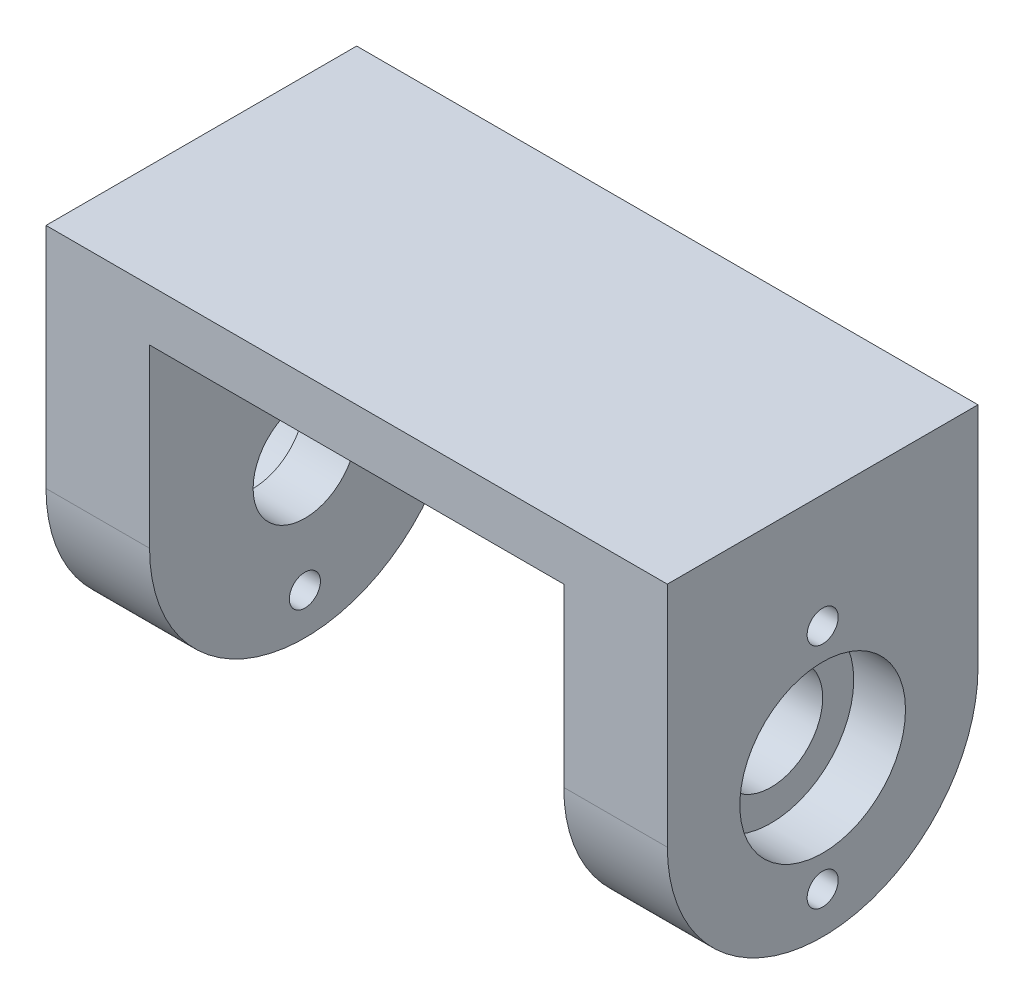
ISO-10303-21;
HEADER;
FILE_DESCRIPTION(('STEP AP214'),'2;1');
FILE_NAME('part.step','',(''),(''),'','','');
FILE_SCHEMA(('AUTOMOTIVE_DESIGN { 1 0 10303 214 1 1 1 1 }'));
ENDSEC;
DATA;
#1=APPLICATION_CONTEXT('core data for automotive mechanical design processes');
#2=APPLICATION_PROTOCOL_DEFINITION('international standard','automotive_design',2000,#1);
#3=PRODUCT_CONTEXT('',#1,'mechanical');
#4=PRODUCT('Part','Part','',(#3));
#5=PRODUCT_RELATED_PRODUCT_CATEGORY('part','',(#4));
#6=PRODUCT_DEFINITION_FORMATION('','',#4);
#7=PRODUCT_DEFINITION_CONTEXT('part definition',#1,'design');
#8=PRODUCT_DEFINITION('design','',#6,#7);
#9=PRODUCT_DEFINITION_SHAPE('','',#8);
#10=(LENGTH_UNIT() NAMED_UNIT(*) SI_UNIT(.MILLI.,.METRE.));
#11=(NAMED_UNIT(*) PLANE_ANGLE_UNIT() SI_UNIT($,.RADIAN.));
#12=(NAMED_UNIT(*) SI_UNIT($,.STERADIAN.) SOLID_ANGLE_UNIT());
#13=UNCERTAINTY_MEASURE_WITH_UNIT(LENGTH_MEASURE(1.E-05),#10,'distance_accuracy_value','');
#14=(GEOMETRIC_REPRESENTATION_CONTEXT(3) GLOBAL_UNCERTAINTY_ASSIGNED_CONTEXT((#13)) GLOBAL_UNIT_ASSIGNED_CONTEXT((#10,
#11,#12)) REPRESENTATION_CONTEXT('',''));
#15=CARTESIAN_POINT('',(0.,0.,0.));
#16=DIRECTION('',(0.,0.,1.));
#17=DIRECTION('',(1.,0.,0.));
#18=AXIS2_PLACEMENT_3D('',#15,#16,#17);
#19=CARTESIAN_POINT('',(60.,0.,0.));
#20=DIRECTION('',(-1.,0.,0.));
#21=DIRECTION('',(0.,0.,1.));
#22=AXIS2_PLACEMENT_3D('',#19,#20,#21);
#23=CYLINDRICAL_SURFACE('',#22,5.);
#24=CARTESIAN_POINT('',(50.,0.,0.));
#25=DIRECTION('',(1.,0.,0.));
#26=DIRECTION('',(0.,1.,0.));
#27=AXIS2_PLACEMENT_3D('',#24,#25,#26);
#28=CIRCLE('',#27,5.);
#29=CARTESIAN_POINT('',(50.,5.,0.));
#30=VERTEX_POINT('',#29);
#31=EDGE_CURVE('E141',#30,#30,#28,.T.);
#32=ORIENTED_EDGE('',*,*,#31,.F.);
#33=EDGE_LOOP('',(#32));
#34=FACE_BOUND('',#33,.T.);
#35=CARTESIAN_POINT('',(55.,0.,0.));
#36=DIRECTION('',(1.,0.,0.));
#37=DIRECTION('',(0.,0.,-1.));
#38=AXIS2_PLACEMENT_3D('',#35,#36,#37);
#39=CIRCLE('',#38,5.);
#40=CARTESIAN_POINT('',(55.,0.,-5.));
#41=VERTEX_POINT('',#40);
#42=EDGE_CURVE('E178',#41,#41,#39,.T.);
#43=ORIENTED_EDGE('',*,*,#42,.T.);
#44=EDGE_LOOP('',(#43));
#45=FACE_BOUND('',#44,.T.);
#46=ADVANCED_FACE('F37',(#34,#45),#23,.F.);
#47=CARTESIAN_POINT('',(9.99999999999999,0.,0.));
#48=DIRECTION('',(-1.,0.,0.));
#49=DIRECTION('',(0.,-1.,0.));
#50=AXIS2_PLACEMENT_3D('',#47,#48,#49);
#51=CIRCLE('',#50,5.);
#52=CARTESIAN_POINT('',(9.99999999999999,-5.,0.));
#53=VERTEX_POINT('',#52);
#54=EDGE_CURVE('E139',#53,#53,#51,.T.);
#55=ORIENTED_EDGE('',*,*,#54,.F.);
#56=EDGE_LOOP('',(#55));
#57=FACE_BOUND('',#56,.T.);
#58=CARTESIAN_POINT('',(5.,0.,0.));
#59=DIRECTION('',(-1.,0.,0.));
#60=DIRECTION('',(0.,0.,1.));
#61=AXIS2_PLACEMENT_3D('',#58,#59,#60);
#62=CIRCLE('',#61,5.);
#63=CARTESIAN_POINT('',(5.,0.,5.));
#64=VERTEX_POINT('',#63);
#65=EDGE_CURVE('E174',#64,#64,#62,.T.);
#66=ORIENTED_EDGE('',*,*,#65,.T.);
#67=EDGE_LOOP('',(#66));
#68=FACE_BOUND('',#67,.T.);
#69=ADVANCED_FACE('F234',(#57,#68),#23,.F.);
#70=CARTESIAN_POINT('',(60.,0.,0.));
#71=DIRECTION('',(-1.,0.,0.));
#72=DIRECTION('',(0.,0.,1.));
#73=AXIS2_PLACEMENT_3D('',#70,#71,#72);
#74=CYLINDRICAL_SURFACE('',#73,15.);
#75=DIRECTION('',(-1.,0.,0.));
#76=VECTOR('',#75,1.);
#77=CARTESIAN_POINT('',(60.,0.,15.));
#78=LINE('',#77,#76);
#79=CARTESIAN_POINT('',(60.,0.,15.));
#80=VERTEX_POINT('',#79);
#81=CARTESIAN_POINT('',(50.,0.,15.));
#82=VERTEX_POINT('',#81);
#83=EDGE_CURVE('E11',#80,#82,#78,.T.);
#84=ORIENTED_EDGE('',*,*,#83,.T.);
#85=CARTESIAN_POINT('',(50.,0.,0.));
#86=DIRECTION('',(1.,0.,0.));
#87=DIRECTION('',(0.,1.,0.));
#88=AXIS2_PLACEMENT_3D('',#85,#86,#87);
#89=CIRCLE('',#88,15.);
#90=CARTESIAN_POINT('',(50.,0.,-15.));
#91=VERTEX_POINT('',#90);
#92=EDGE_CURVE('E114',#82,#91,#89,.T.);
#93=ORIENTED_EDGE('',*,*,#92,.T.);
#94=DIRECTION('',(-1.,0.,0.));
#95=VECTOR('',#94,1.);
#96=CARTESIAN_POINT('',(60.,0.,-15.));
#97=LINE('',#96,#95);
#98=CARTESIAN_POINT('',(60.,0.,-15.));
#99=VERTEX_POINT('',#98);
#100=EDGE_CURVE('E167',#99,#91,#97,.T.);
#101=ORIENTED_EDGE('',*,*,#100,.F.);
#102=CARTESIAN_POINT('',(60.,0.,0.));
#103=DIRECTION('',(1.,0.,0.));
#104=DIRECTION('',(0.,0.,-1.));
#105=AXIS2_PLACEMENT_3D('',#102,#103,#104);
#106=CIRCLE('',#105,15.);
#107=EDGE_CURVE('E146',#80,#99,#106,.T.);
#108=ORIENTED_EDGE('',*,*,#107,.F.);
#109=EDGE_LOOP('',(#84,#93,#101,#108));
#110=FACE_BOUND('',#109,.T.);
#111=ADVANCED_FACE('F214',(#110),#74,.T.);
#112=CARTESIAN_POINT('',(60.,0.,15.));
#113=DIRECTION('',(0.,0.,1.));
#114=DIRECTION('',(1.,0.,0.));
#115=AXIS2_PLACEMENT_3D('',#112,#113,#114);
#116=PLANE('',#115);
#117=DIRECTION('',(0.,-1.,0.));
#118=VECTOR('',#117,1.);
#119=CARTESIAN_POINT('',(50.,17.,15.));
#120=LINE('',#119,#118);
#121=CARTESIAN_POINT('',(50.,17.,15.));
#122=VERTEX_POINT('',#121);
#123=EDGE_CURVE('E108',#122,#82,#120,.T.);
#124=ORIENTED_EDGE('',*,*,#123,.T.);
#125=ORIENTED_EDGE('',*,*,#83,.F.);
#126=DIRECTION('',(0.,1.,0.));
#127=VECTOR('',#126,1.);
#128=CARTESIAN_POINT('',(60.,0.,15.));
#129=LINE('',#128,#127);
#130=CARTESIAN_POINT('',(60.,22.,15.));
#131=VERTEX_POINT('',#130);
#132=EDGE_CURVE('E144',#80,#131,#129,.T.);
#133=ORIENTED_EDGE('',*,*,#132,.T.);
#134=DIRECTION('',(-1.,0.,0.));
#135=VECTOR('',#134,1.);
#136=CARTESIAN_POINT('',(60.,22.,15.));
#137=LINE('',#136,#135);
#138=CARTESIAN_POINT('',(0.,22.,15.));
#139=VERTEX_POINT('',#138);
#140=EDGE_CURVE('E63',#131,#139,#137,.T.);
#141=ORIENTED_EDGE('',*,*,#140,.T.);
#142=DIRECTION('',(0.,1.,0.));
#143=VECTOR('',#142,1.);
#144=CARTESIAN_POINT('',(0.,0.,15.));
#145=LINE('',#144,#143);
#146=CARTESIAN_POINT('',(0.,0.,15.));
#147=VERTEX_POINT('',#146);
#148=EDGE_CURVE('E143',#147,#139,#145,.T.);
#149=ORIENTED_EDGE('',*,*,#148,.F.);
#150=CARTESIAN_POINT('',(9.99999999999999,0.,15.));
#151=VERTEX_POINT('',#150);
#152=EDGE_CURVE('E46',#151,#147,#78,.T.);
#153=ORIENTED_EDGE('',*,*,#152,.F.);
#154=DIRECTION('',(0.,1.,0.));
#155=VECTOR('',#154,1.);
#156=CARTESIAN_POINT('',(9.99999999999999,17.,15.));
#157=LINE('',#156,#155);
#158=CARTESIAN_POINT('',(9.99999999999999,17.,15.));
#159=VERTEX_POINT('',#158);
#160=EDGE_CURVE('E116',#151,#159,#157,.T.);
#161=ORIENTED_EDGE('',*,*,#160,.T.);
#162=DIRECTION('',(1.,0.,0.));
#163=VECTOR('',#162,1.);
#164=CARTESIAN_POINT('',(9.99999999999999,17.,15.));
#165=LINE('',#164,#163);
#166=EDGE_CURVE('E121',#159,#122,#165,.T.);
#167=ORIENTED_EDGE('',*,*,#166,.T.);
#168=EDGE_LOOP('',(#124,#125,#133,#141,#149,#153,#161,#167));
#169=FACE_BOUND('',#168,.T.);
#170=ADVANCED_FACE('F39',(#169),#116,.T.);
#171=CARTESIAN_POINT('',(9.99999999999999,0.,-15.));
#172=VERTEX_POINT('',#171);
#173=CARTESIAN_POINT('',(0.,0.,-15.));
#174=VERTEX_POINT('',#173);
#175=EDGE_CURVE('E166',#172,#174,#97,.T.);
#176=ORIENTED_EDGE('',*,*,#175,.F.);
#177=CARTESIAN_POINT('',(9.99999999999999,0.,0.));
#178=DIRECTION('',(-1.,0.,0.));
#179=DIRECTION('',(0.,-1.,0.));
#180=AXIS2_PLACEMENT_3D('',#177,#178,#179);
#181=CIRCLE('',#180,15.);
#182=EDGE_CURVE('E54',#172,#151,#181,.T.);
#183=ORIENTED_EDGE('',*,*,#182,.T.);
#184=ORIENTED_EDGE('',*,*,#152,.T.);
#185=CARTESIAN_POINT('',(0.,0.,0.));
#186=DIRECTION('',(1.,0.,0.));
#187=DIRECTION('',(0.,0.,-1.));
#188=AXIS2_PLACEMENT_3D('',#185,#186,#187);
#189=CIRCLE('',#188,15.);
#190=EDGE_CURVE('E155',#147,#174,#189,.T.);
#191=ORIENTED_EDGE('',*,*,#190,.T.);
#192=EDGE_LOOP('',(#176,#183,#184,#191));
#193=FACE_BOUND('',#192,.T.);
#194=ADVANCED_FACE('F226',(#193),#74,.T.);
#195=CARTESIAN_POINT('',(60.,0.,-15.));
#196=DIRECTION('',(0.,0.,-1.));
#197=DIRECTION('',(-1.,0.,0.));
#198=AXIS2_PLACEMENT_3D('',#195,#196,#197);
#199=PLANE('',#198);
#200=DIRECTION('',(0.,-1.,0.));
#201=VECTOR('',#200,1.);
#202=CARTESIAN_POINT('',(50.,17.,-15.));
#203=LINE('',#202,#201);
#204=CARTESIAN_POINT('',(50.,17.,-15.));
#205=VERTEX_POINT('',#204);
#206=EDGE_CURVE('E129',#205,#91,#203,.T.);
#207=ORIENTED_EDGE('',*,*,#206,.F.);
#208=DIRECTION('',(1.,0.,0.));
#209=VECTOR('',#208,1.);
#210=CARTESIAN_POINT('',(9.99999999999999,17.,-15.));
#211=LINE('',#210,#209);
#212=CARTESIAN_POINT('',(9.99999999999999,17.,-15.));
#213=VERTEX_POINT('',#212);
#214=EDGE_CURVE('E124',#213,#205,#211,.T.);
#215=ORIENTED_EDGE('',*,*,#214,.F.);
#216=DIRECTION('',(0.,1.,0.));
#217=VECTOR('',#216,1.);
#218=CARTESIAN_POINT('',(9.99999999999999,17.,-15.));
#219=LINE('',#218,#217);
#220=EDGE_CURVE('E134',#172,#213,#219,.T.);
#221=ORIENTED_EDGE('',*,*,#220,.F.);
#222=ORIENTED_EDGE('',*,*,#175,.T.);
#223=DIRECTION('',(0.,-1.,0.));
#224=VECTOR('',#223,1.);
#225=CARTESIAN_POINT('',(0.,0.,-15.));
#226=LINE('',#225,#224);
#227=CARTESIAN_POINT('',(0.,22.,-15.));
#228=VERTEX_POINT('',#227);
#229=EDGE_CURVE('E158',#228,#174,#226,.T.);
#230=ORIENTED_EDGE('',*,*,#229,.F.);
#231=DIRECTION('',(-1.,0.,0.));
#232=VECTOR('',#231,1.);
#233=CARTESIAN_POINT('',(60.,22.,-15.));
#234=LINE('',#233,#232);
#235=CARTESIAN_POINT('',(60.,22.,-15.));
#236=VERTEX_POINT('',#235);
#237=EDGE_CURVE('E164',#236,#228,#234,.T.);
#238=ORIENTED_EDGE('',*,*,#237,.F.);
#239=DIRECTION('',(0.,-1.,0.));
#240=VECTOR('',#239,1.);
#241=CARTESIAN_POINT('',(60.,0.,-15.));
#242=LINE('',#241,#240);
#243=EDGE_CURVE('E149',#236,#99,#242,.T.);
#244=ORIENTED_EDGE('',*,*,#243,.T.);
#245=ORIENTED_EDGE('',*,*,#100,.T.);
#246=EDGE_LOOP('',(#207,#215,#221,#222,#230,#238,#244,#245));
#247=FACE_BOUND('',#246,.T.);
#248=ADVANCED_FACE('F211',(#247),#199,.T.);
#249=CARTESIAN_POINT('',(60.,22.,0.));
#250=DIRECTION('',(0.,1.,0.));
#251=DIRECTION('',(0.,0.,1.));
#252=AXIS2_PLACEMENT_3D('',#249,#250,#251);
#253=PLANE('',#252);
#254=DIRECTION('',(0.,0.,-1.));
#255=VECTOR('',#254,1.);
#256=CARTESIAN_POINT('',(0.,22.,0.));
#257=LINE('',#256,#255);
#258=EDGE_CURVE('E147',#139,#228,#257,.T.);
#259=ORIENTED_EDGE('',*,*,#258,.F.);
#260=ORIENTED_EDGE('',*,*,#140,.F.);
#261=DIRECTION('',(0.,0.,-1.));
#262=VECTOR('',#261,1.);
#263=CARTESIAN_POINT('',(60.,22.,0.));
#264=LINE('',#263,#262);
#265=EDGE_CURVE('E152',#131,#236,#264,.T.);
#266=ORIENTED_EDGE('',*,*,#265,.T.);
#267=ORIENTED_EDGE('',*,*,#237,.T.);
#268=EDGE_LOOP('',(#259,#260,#266,#267));
#269=FACE_BOUND('',#268,.T.);
#270=ADVANCED_FACE('F220',(#269),#253,.T.);
#271=CARTESIAN_POINT('',(60.,0.,0.));
#272=DIRECTION('',(1.,0.,0.));
#273=DIRECTION('',(0.,0.,-1.));
#274=AXIS2_PLACEMENT_3D('',#271,#272,#273);
#275=PLANE('',#274);
#276=CARTESIAN_POINT('',(60.,11.,0.));
#277=DIRECTION('',(1.,0.,0.));
#278=DIRECTION('',(0.,0.,-1.));
#279=AXIS2_PLACEMENT_3D('',#276,#277,#278);
#280=CIRCLE('',#279,1.5);
#281=CARTESIAN_POINT('',(60.,11.,-1.5));
#282=VERTEX_POINT('',#281);
#283=EDGE_CURVE('E298',#282,#282,#280,.T.);
#284=ORIENTED_EDGE('',*,*,#283,.F.);
#285=EDGE_LOOP('',(#284));
#286=FACE_BOUND('',#285,.T.);
#287=CARTESIAN_POINT('',(60.,-11.,0.));
#288=DIRECTION('',(1.,0.,0.));
#289=DIRECTION('',(0.,0.,-1.));
#290=AXIS2_PLACEMENT_3D('',#287,#288,#289);
#291=CIRCLE('',#290,1.5);
#292=CARTESIAN_POINT('',(60.,-11.,-1.5));
#293=VERTEX_POINT('',#292);
#294=EDGE_CURVE('E192',#293,#293,#291,.T.);
#295=ORIENTED_EDGE('',*,*,#294,.F.);
#296=EDGE_LOOP('',(#295));
#297=FACE_BOUND('',#296,.T.);
#298=CARTESIAN_POINT('',(60.,0.,0.));
#299=DIRECTION('',(1.,0.,0.));
#300=DIRECTION('',(0.,0.,-1.));
#301=AXIS2_PLACEMENT_3D('',#298,#299,#300);
#302=CIRCLE('',#301,8.);
#303=CARTESIAN_POINT('',(60.,0.,-8.));
#304=VERTEX_POINT('',#303);
#305=EDGE_CURVE('E189',#304,#304,#302,.T.);
#306=ORIENTED_EDGE('',*,*,#305,.F.);
#307=EDGE_LOOP('',(#306));
#308=FACE_BOUND('',#307,.T.);
#309=ORIENTED_EDGE('',*,*,#132,.F.);
#310=ORIENTED_EDGE('',*,*,#107,.T.);
#311=ORIENTED_EDGE('',*,*,#243,.F.);
#312=ORIENTED_EDGE('',*,*,#265,.F.);
#313=EDGE_LOOP('',(#309,#310,#311,#312));
#314=FACE_BOUND('',#313,.T.);
#315=ADVANCED_FACE('F219',(#286,#297,#308,#314),#275,.T.);
#316=CARTESIAN_POINT('',(0.,0.,0.));
#317=DIRECTION('',(1.,0.,0.));
#318=DIRECTION('',(0.,0.,-1.));
#319=AXIS2_PLACEMENT_3D('',#316,#317,#318);
#320=PLANE('',#319);
#321=CARTESIAN_POINT('',(0.,11.,0.));
#322=DIRECTION('',(1.,0.,0.));
#323=DIRECTION('',(0.,0.,-1.));
#324=AXIS2_PLACEMENT_3D('',#321,#322,#323);
#325=CIRCLE('',#324,1.5);
#326=CARTESIAN_POINT('',(0.,11.,-1.5));
#327=VERTEX_POINT('',#326);
#328=EDGE_CURVE('E302',#327,#327,#325,.F.);
#329=ORIENTED_EDGE('',*,*,#328,.F.);
#330=EDGE_LOOP('',(#329));
#331=FACE_BOUND('',#330,.T.);
#332=CARTESIAN_POINT('',(0.,-11.,0.));
#333=DIRECTION('',(1.,0.,0.));
#334=DIRECTION('',(0.,0.,-1.));
#335=AXIS2_PLACEMENT_3D('',#332,#333,#334);
#336=CIRCLE('',#335,1.5);
#337=CARTESIAN_POINT('',(0.,-11.,-1.5));
#338=VERTEX_POINT('',#337);
#339=EDGE_CURVE('E185',#338,#338,#336,.F.);
#340=ORIENTED_EDGE('',*,*,#339,.F.);
#341=EDGE_LOOP('',(#340));
#342=FACE_BOUND('',#341,.T.);
#343=CARTESIAN_POINT('',(0.,0.,0.));
#344=DIRECTION('',(-1.,0.,0.));
#345=DIRECTION('',(0.,0.,1.));
#346=AXIS2_PLACEMENT_3D('',#343,#344,#345);
#347=CIRCLE('',#346,8.);
#348=CARTESIAN_POINT('',(0.,0.,8.));
#349=VERTEX_POINT('',#348);
#350=EDGE_CURVE('E180',#349,#349,#347,.T.);
#351=ORIENTED_EDGE('',*,*,#350,.F.);
#352=EDGE_LOOP('',(#351));
#353=FACE_BOUND('',#352,.T.);
#354=ORIENTED_EDGE('',*,*,#148,.T.);
#355=ORIENTED_EDGE('',*,*,#258,.T.);
#356=ORIENTED_EDGE('',*,*,#229,.T.);
#357=ORIENTED_EDGE('',*,*,#190,.F.);
#358=EDGE_LOOP('',(#354,#355,#356,#357));
#359=FACE_BOUND('',#358,.T.);
#360=ADVANCED_FACE('F224',(#331,#342,#353,#359),#320,.F.);
#361=CARTESIAN_POINT('',(50.,17.,87.1110255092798));
#362=DIRECTION('',(1.,0.,0.));
#363=DIRECTION('',(0.,1.,0.));
#364=AXIS2_PLACEMENT_3D('',#361,#362,#363);
#365=PLANE('',#364);
#366=CARTESIAN_POINT('',(50.,11.,0.));
#367=DIRECTION('',(1.,0.,0.));
#368=DIRECTION('',(0.,1.,0.));
#369=AXIS2_PLACEMENT_3D('',#366,#367,#368);
#370=CIRCLE('',#369,1.5);
#371=CARTESIAN_POINT('',(50.,12.5,0.));
#372=VERTEX_POINT('',#371);
#373=EDGE_CURVE('E197',#372,#372,#370,.T.);
#374=ORIENTED_EDGE('',*,*,#373,.T.);
#375=EDGE_LOOP('',(#374));
#376=FACE_BOUND('',#375,.T.);
#377=CARTESIAN_POINT('',(50.,-11.,0.));
#378=DIRECTION('',(1.,0.,0.));
#379=DIRECTION('',(0.,1.,0.));
#380=AXIS2_PLACEMENT_3D('',#377,#378,#379);
#381=CIRCLE('',#380,1.5);
#382=CARTESIAN_POINT('',(50.,-9.5,0.));
#383=VERTEX_POINT('',#382);
#384=EDGE_CURVE('E184',#383,#383,#381,.T.);
#385=ORIENTED_EDGE('',*,*,#384,.T.);
#386=EDGE_LOOP('',(#385));
#387=FACE_BOUND('',#386,.T.);
#388=ORIENTED_EDGE('',*,*,#31,.T.);
#389=EDGE_LOOP('',(#388));
#390=FACE_BOUND('',#389,.T.);
#391=ORIENTED_EDGE('',*,*,#123,.F.);
#392=DIRECTION('',(0.,0.,-1.));
#393=VECTOR('',#392,1.);
#394=CARTESIAN_POINT('',(50.,17.,87.1110255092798));
#395=LINE('',#394,#393);
#396=EDGE_CURVE('E111',#122,#205,#395,.T.);
#397=ORIENTED_EDGE('',*,*,#396,.T.);
#398=ORIENTED_EDGE('',*,*,#206,.T.);
#399=ORIENTED_EDGE('',*,*,#92,.F.);
#400=EDGE_LOOP('',(#391,#397,#398,#399));
#401=FACE_BOUND('',#400,.T.);
#402=ADVANCED_FACE('F110',(#376,#387,#390,#401),#365,.F.);
#403=CARTESIAN_POINT('',(9.99999999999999,17.,87.1110255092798));
#404=DIRECTION('',(-1.,0.,0.));
#405=DIRECTION('',(0.,-1.,0.));
#406=AXIS2_PLACEMENT_3D('',#403,#404,#405);
#407=PLANE('',#406);
#408=CARTESIAN_POINT('',(9.99999999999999,11.,0.));
#409=DIRECTION('',(-1.,0.,0.));
#410=DIRECTION('',(0.,-1.,0.));
#411=AXIS2_PLACEMENT_3D('',#408,#409,#410);
#412=CIRCLE('',#411,1.5);
#413=CARTESIAN_POINT('',(9.99999999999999,9.5,0.));
#414=VERTEX_POINT('',#413);
#415=EDGE_CURVE('E41',#414,#414,#412,.T.);
#416=ORIENTED_EDGE('',*,*,#415,.T.);
#417=EDGE_LOOP('',(#416));
#418=FACE_BOUND('',#417,.T.);
#419=CARTESIAN_POINT('',(9.99999999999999,-11.,0.));
#420=DIRECTION('',(-1.,0.,0.));
#421=DIRECTION('',(0.,-1.,0.));
#422=AXIS2_PLACEMENT_3D('',#419,#420,#421);
#423=CIRCLE('',#422,1.5);
#424=CARTESIAN_POINT('',(9.99999999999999,-12.5,0.));
#425=VERTEX_POINT('',#424);
#426=EDGE_CURVE('E182',#425,#425,#423,.T.);
#427=ORIENTED_EDGE('',*,*,#426,.T.);
#428=EDGE_LOOP('',(#427));
#429=FACE_BOUND('',#428,.T.);
#430=ORIENTED_EDGE('',*,*,#54,.T.);
#431=EDGE_LOOP('',(#430));
#432=FACE_BOUND('',#431,.T.);
#433=ORIENTED_EDGE('',*,*,#220,.T.);
#434=DIRECTION('',(0.,0.,-1.));
#435=VECTOR('',#434,1.);
#436=CARTESIAN_POINT('',(9.99999999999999,17.,87.1110255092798));
#437=LINE('',#436,#435);
#438=EDGE_CURVE('E136',#159,#213,#437,.T.);
#439=ORIENTED_EDGE('',*,*,#438,.F.);
#440=ORIENTED_EDGE('',*,*,#160,.F.);
#441=ORIENTED_EDGE('',*,*,#182,.F.);
#442=EDGE_LOOP('',(#433,#439,#440,#441));
#443=FACE_BOUND('',#442,.T.);
#444=ADVANCED_FACE('F208',(#418,#429,#432,#443),#407,.F.);
#445=CARTESIAN_POINT('',(9.99999999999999,17.,87.1110255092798));
#446=DIRECTION('',(0.,1.,0.));
#447=DIRECTION('',(-1.,0.,0.));
#448=AXIS2_PLACEMENT_3D('',#445,#446,#447);
#449=PLANE('',#448);
#450=ORIENTED_EDGE('',*,*,#438,.T.);
#451=ORIENTED_EDGE('',*,*,#214,.T.);
#452=ORIENTED_EDGE('',*,*,#396,.F.);
#453=ORIENTED_EDGE('',*,*,#166,.F.);
#454=EDGE_LOOP('',(#450,#451,#452,#453));
#455=FACE_BOUND('',#454,.T.);
#456=ADVANCED_FACE('F120',(#455),#449,.F.);
#457=CARTESIAN_POINT('',(5.,0.,0.));
#458=DIRECTION('',(-1.,0.,0.));
#459=DIRECTION('',(0.,0.,1.));
#460=AXIS2_PLACEMENT_3D('',#457,#458,#459);
#461=CYLINDRICAL_SURFACE('',#460,8.);
#462=CARTESIAN_POINT('',(5.,0.,0.));
#463=DIRECTION('',(-1.,0.,0.));
#464=DIRECTION('',(0.,0.,1.));
#465=AXIS2_PLACEMENT_3D('',#462,#463,#464);
#466=CIRCLE('',#465,8.);
#467=CARTESIAN_POINT('',(5.,0.,8.));
#468=VERTEX_POINT('',#467);
#469=EDGE_CURVE('E177',#468,#468,#466,.T.);
#470=ORIENTED_EDGE('',*,*,#469,.F.);
#471=EDGE_LOOP('',(#470));
#472=FACE_BOUND('',#471,.T.);
#473=ORIENTED_EDGE('',*,*,#350,.T.);
#474=EDGE_LOOP('',(#473));
#475=FACE_BOUND('',#474,.T.);
#476=ADVANCED_FACE('F261',(#472,#475),#461,.F.);
#477=CARTESIAN_POINT('',(5.,0.,0.));
#478=DIRECTION('',(-1.,0.,0.));
#479=DIRECTION('',(0.,0.,1.));
#480=AXIS2_PLACEMENT_3D('',#477,#478,#479);
#481=PLANE('',#480);
#482=ORIENTED_EDGE('',*,*,#65,.F.);
#483=EDGE_LOOP('',(#482));
#484=FACE_BOUND('',#483,.T.);
#485=ORIENTED_EDGE('',*,*,#469,.T.);
#486=EDGE_LOOP('',(#485));
#487=FACE_BOUND('',#486,.T.);
#488=ADVANCED_FACE('F270',(#484,#487),#481,.T.);
#489=CARTESIAN_POINT('',(55.,0.,0.));
#490=DIRECTION('',(1.,0.,0.));
#491=DIRECTION('',(0.,0.,-1.));
#492=AXIS2_PLACEMENT_3D('',#489,#490,#491);
#493=CYLINDRICAL_SURFACE('',#492,8.);
#494=CARTESIAN_POINT('',(55.,0.,0.));
#495=DIRECTION('',(1.,0.,0.));
#496=DIRECTION('',(0.,0.,-1.));
#497=AXIS2_PLACEMENT_3D('',#494,#495,#496);
#498=CIRCLE('',#497,8.);
#499=CARTESIAN_POINT('',(55.,0.,-8.));
#500=VERTEX_POINT('',#499);
#501=EDGE_CURVE('E181',#500,#500,#498,.T.);
#502=ORIENTED_EDGE('',*,*,#501,.F.);
#503=EDGE_LOOP('',(#502));
#504=FACE_BOUND('',#503,.T.);
#505=ORIENTED_EDGE('',*,*,#305,.T.);
#506=EDGE_LOOP('',(#505));
#507=FACE_BOUND('',#506,.T.);
#508=ADVANCED_FACE('F274',(#504,#507),#493,.F.);
#509=CARTESIAN_POINT('',(55.,0.,0.));
#510=DIRECTION('',(1.,0.,0.));
#511=DIRECTION('',(0.,0.,-1.));
#512=AXIS2_PLACEMENT_3D('',#509,#510,#511);
#513=PLANE('',#512);
#514=ORIENTED_EDGE('',*,*,#42,.F.);
#515=EDGE_LOOP('',(#514));
#516=FACE_BOUND('',#515,.T.);
#517=ORIENTED_EDGE('',*,*,#501,.T.);
#518=EDGE_LOOP('',(#517));
#519=FACE_BOUND('',#518,.T.);
#520=ADVANCED_FACE('F278',(#516,#519),#513,.T.);
#521=CARTESIAN_POINT('',(-4.24264068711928,-11.,0.));
#522=DIRECTION('',(1.,0.,0.));
#523=DIRECTION('',(0.,0.,-1.));
#524=AXIS2_PLACEMENT_3D('',#521,#522,#523);
#525=CYLINDRICAL_SURFACE('',#524,1.5);
#526=ORIENTED_EDGE('',*,*,#339,.T.);
#527=EDGE_LOOP('',(#526));
#528=FACE_BOUND('',#527,.T.);
#529=ORIENTED_EDGE('',*,*,#426,.F.);
#530=EDGE_LOOP('',(#529));
#531=FACE_BOUND('',#530,.T.);
#532=ADVANCED_FACE('F282',(#528,#531),#525,.F.);
#533=ORIENTED_EDGE('',*,*,#294,.T.);
#534=EDGE_LOOP('',(#533));
#535=FACE_BOUND('',#534,.T.);
#536=ORIENTED_EDGE('',*,*,#384,.F.);
#537=EDGE_LOOP('',(#536));
#538=FACE_BOUND('',#537,.T.);
#539=ADVANCED_FACE('F284',(#535,#538),#525,.F.);
#540=CARTESIAN_POINT('',(-4.24264068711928,11.,0.));
#541=DIRECTION('',(1.,0.,0.));
#542=DIRECTION('',(0.,0.,-1.));
#543=AXIS2_PLACEMENT_3D('',#540,#541,#542);
#544=CYLINDRICAL_SURFACE('',#543,1.5);
#545=ORIENTED_EDGE('',*,*,#328,.T.);
#546=EDGE_LOOP('',(#545));
#547=FACE_BOUND('',#546,.T.);
#548=ORIENTED_EDGE('',*,*,#415,.F.);
#549=EDGE_LOOP('',(#548));
#550=FACE_BOUND('',#549,.T.);
#551=ADVANCED_FACE('F287',(#547,#550),#544,.F.);
#552=ORIENTED_EDGE('',*,*,#283,.T.);
#553=EDGE_LOOP('',(#552));
#554=FACE_BOUND('',#553,.T.);
#555=ORIENTED_EDGE('',*,*,#373,.F.);
#556=EDGE_LOOP('',(#555));
#557=FACE_BOUND('',#556,.T.);
#558=ADVANCED_FACE('F289',(#554,#557),#544,.F.);
#559=CLOSED_SHELL('',(#46,#69,#111,#170,#194,#248,#270,#315,#360,#402,#444,#456,#476,#488,#508,
#520,#532,#539,#551,#558));
#560=MANIFOLD_SOLID_BREP('B2',#559);
#561=ADVANCED_BREP_SHAPE_REPRESENTATION('',(#18,#560),#14);
#562=SHAPE_DEFINITION_REPRESENTATION(#9,#561);
ENDSEC;
END-ISO-10303-21;
